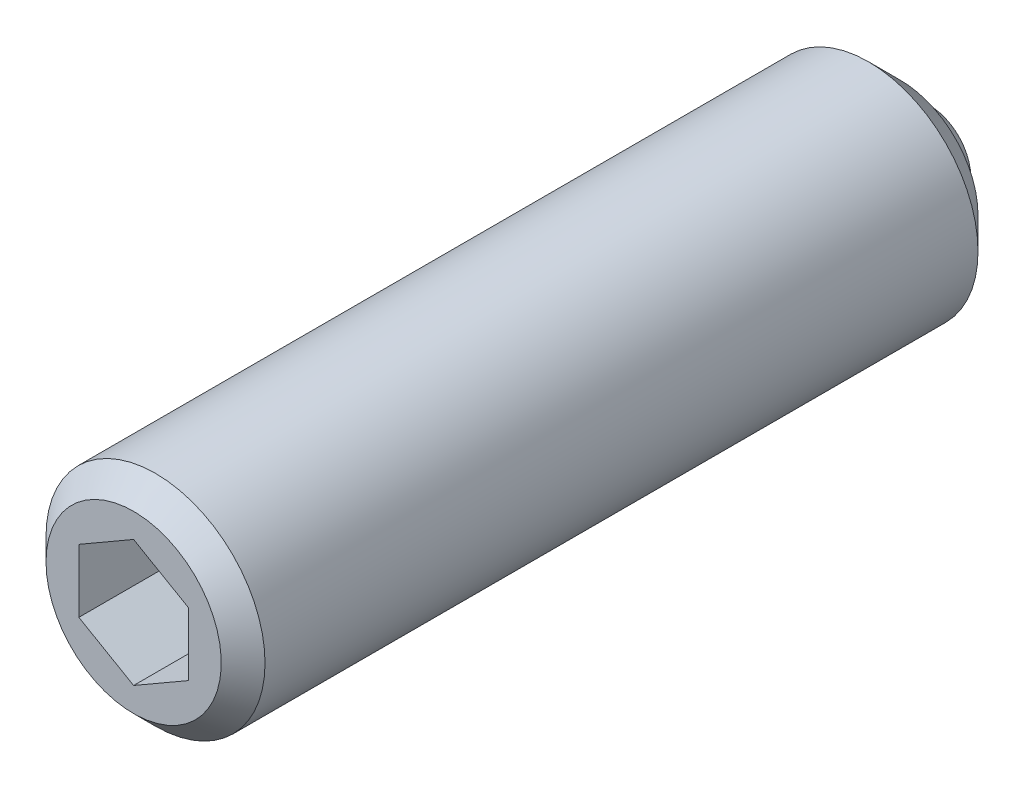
ISO-10303-21;
HEADER;
FILE_DESCRIPTION(('STEP AP214'),'2;1');
FILE_NAME('part.step','',(''),(''),'','','');
FILE_SCHEMA(('AUTOMOTIVE_DESIGN { 1 0 10303 214 1 1 1 1 }'));
ENDSEC;
DATA;
#1=APPLICATION_CONTEXT('core data for automotive mechanical design processes');
#2=APPLICATION_PROTOCOL_DEFINITION('international standard','automotive_design',2000,#1);
#3=PRODUCT_CONTEXT('',#1,'mechanical');
#4=PRODUCT('Part','Part','',(#3));
#5=PRODUCT_RELATED_PRODUCT_CATEGORY('part','',(#4));
#6=PRODUCT_DEFINITION_FORMATION('','',#4);
#7=PRODUCT_DEFINITION_CONTEXT('part definition',#1,'design');
#8=PRODUCT_DEFINITION('design','',#6,#7);
#9=PRODUCT_DEFINITION_SHAPE('','',#8);
#10=(LENGTH_UNIT() NAMED_UNIT(*) SI_UNIT(.MILLI.,.METRE.));
#11=(NAMED_UNIT(*) PLANE_ANGLE_UNIT() SI_UNIT($,.RADIAN.));
#12=(NAMED_UNIT(*) SI_UNIT($,.STERADIAN.) SOLID_ANGLE_UNIT());
#13=UNCERTAINTY_MEASURE_WITH_UNIT(LENGTH_MEASURE(1.E-05),#10,'distance_accuracy_value','');
#14=(GEOMETRIC_REPRESENTATION_CONTEXT(3) GLOBAL_UNCERTAINTY_ASSIGNED_CONTEXT((#13)) GLOBAL_UNIT_ASSIGNED_CONTEXT((#10,
#11,#12)) REPRESENTATION_CONTEXT('',''));
#15=CARTESIAN_POINT('',(0.,0.,0.));
#16=DIRECTION('',(0.,0.,1.));
#17=DIRECTION('',(1.,0.,0.));
#18=AXIS2_PLACEMENT_3D('',#15,#16,#17);
#19=CARTESIAN_POINT('',(5.04709724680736E-10,0.,-12.1421356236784));
#20=DIRECTION('',(-4.15668001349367E-11,0.,1.));
#21=DIRECTION('',(1.,0.,4.15668001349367E-11));
#22=AXIS2_PLACEMENT_3D('',#19,#20,#21);
#23=CYLINDRICAL_SURFACE('',#22,5.);
#24=CARTESIAN_POINT('',(-1.4964048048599E-09,-1.52491229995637E-13,36.0000000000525));
#25=DIRECTION('',(4.15668001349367E-11,0.,-1.));
#26=DIRECTION('',(-1.,0.,-4.15668001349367E-11));
#27=AXIS2_PLACEMENT_3D('',#24,#25,#26);
#28=CIRCLE('',#27,5.);
#29=CARTESIAN_POINT('',(-5.0000000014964,-1.52491229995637E-13,35.9999999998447));
#30=VERTEX_POINT('',#29);
#31=EDGE_CURVE('E9',#30,#30,#28,.T.);
#32=ORIENTED_EDGE('',*,*,#31,.T.);
#33=EDGE_LOOP('',(#32));
#34=FACE_BOUND('',#33,.T.);
#35=CARTESIAN_POINT('',(-1.43405460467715E-10,0.,3.45000000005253));
#36=DIRECTION('',(-4.15668001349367E-11,0.,1.));
#37=DIRECTION('',(1.,0.,4.15668001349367E-11));
#38=AXIS2_PLACEMENT_3D('',#35,#36,#37);
#39=CIRCLE('',#38,5.);
#40=CARTESIAN_POINT('',(4.99999999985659,0.,3.45000000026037));
#41=VERTEX_POINT('',#40);
#42=EDGE_CURVE('E118',#41,#41,#39,.T.);
#43=ORIENTED_EDGE('',*,*,#42,.T.);
#44=EDGE_LOOP('',(#43));
#45=FACE_BOUND('',#44,.T.);
#46=ADVANCED_FACE('F14',(#34,#45),#23,.T.);
#47=CARTESIAN_POINT('',(1.24999999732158,3.60843918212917,33.0000000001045));
#48=DIRECTION('',(4.15668001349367E-11,0.,-1.));
#49=DIRECTION('',(0.500000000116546,-0.866025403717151,2.07797317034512E-11));
#50=AXIS2_PLACEMENT_3D('',#47,#48,#49);
#51=PLANE('',#50);
#52=DIRECTION('',(0.866025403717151,0.500000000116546,3.6000022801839E-11));
#53=VECTOR('',#52,1.);
#54=CARTESIAN_POINT('',(1.24999999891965,-2.16506350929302,33.0000000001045));
#55=LINE('',#54,#53);
#56=CARTESIAN_POINT('',(-2.14420061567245E-10,-2.88675134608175,33.0000000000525));
#57=VERTEX_POINT('',#56);
#58=CARTESIAN_POINT('',(2.49999999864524,-1.44337567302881,33.0000000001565));
#59=VERTEX_POINT('',#58);
#60=EDGE_CURVE('E109',#57,#59,#55,.T.);
#61=ORIENTED_EDGE('',*,*,#60,.T.);
#62=DIRECTION('',(0.,1.,0.));
#63=VECTOR('',#62,1.);
#64=CARTESIAN_POINT('',(2.49999999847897,-3.27267943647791E-10,33.0000000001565));
#65=LINE('',#64,#63);
#66=CARTESIAN_POINT('',(2.49999999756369,1.44337567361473,33.0000000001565));
#67=VERTEX_POINT('',#66);
#68=EDGE_CURVE('E105',#59,#67,#65,.T.);
#69=ORIENTED_EDGE('',*,*,#68,.T.);
#70=DIRECTION('',(-0.866025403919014,0.499999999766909,-3.59957869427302E-11));
#71=VECTOR('',#70,1.);
#72=CARTESIAN_POINT('',(1.2499999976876,2.16506350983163,33.0000000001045));
#73=LINE('',#72,#71);
#74=CARTESIAN_POINT('',(-2.52900131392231E-09,2.88675134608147,33.0000000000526));
#75=VERTEX_POINT('',#74);
#76=EDGE_CURVE('E101',#67,#75,#73,.T.);
#77=ORIENTED_EDGE('',*,*,#76,.T.);
#78=DIRECTION('',(-0.866025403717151,-0.500000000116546,-3.6000022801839E-11));
#79=VECTOR('',#78,1.);
#80=CARTESIAN_POINT('',(-1.25000000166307,2.16506350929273,33.0000000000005));
#81=LINE('',#80,#79);
#82=CARTESIAN_POINT('',(-2.50000000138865,1.44337567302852,32.9999999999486));
#83=VERTEX_POINT('',#82);
#84=EDGE_CURVE('E46',#75,#83,#81,.T.);
#85=ORIENTED_EDGE('',*,*,#84,.T.);
#86=DIRECTION('',(0.,-1.,0.));
#87=VECTOR('',#86,1.);
#88=CARTESIAN_POINT('',(-2.50000000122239,3.26976943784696E-10,32.9999999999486));
#89=LINE('',#88,#87);
#90=CARTESIAN_POINT('',(-2.50000000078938,-1.44337567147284,32.9999999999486));
#91=VERTEX_POINT('',#90);
#92=EDGE_CURVE('E83',#83,#91,#89,.T.);
#93=ORIENTED_EDGE('',*,*,#92,.T.);
#94=DIRECTION('',(0.866025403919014,-0.499999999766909,3.59957869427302E-11));
#95=VECTOR('',#94,1.);
#96=CARTESIAN_POINT('',(-1.25000000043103,-2.16506350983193,33.0000000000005));
#97=LINE('',#96,#95);
#98=EDGE_CURVE('E31',#91,#57,#97,.T.);
#99=ORIENTED_EDGE('',*,*,#98,.T.);
#100=EDGE_LOOP('',(#61,#69,#77,#85,#93,#99));
#101=FACE_BOUND('',#100,.T.);
#102=ADVANCED_FACE('F135',(#101),#51,.F.);
#103=CARTESIAN_POINT('',(-2.50000000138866,-1.4433756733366,36.9999999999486));
#104=DIRECTION('',(-1.,0.,-4.15668001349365E-11));
#105=DIRECTION('',(0.,1.,0.));
#106=AXIS2_PLACEMENT_3D('',#103,#104,#105);
#107=PLANE('',#106);
#108=ORIENTED_EDGE('',*,*,#92,.F.);
#109=DIRECTION('',(4.15668001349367E-11,0.,-1.));
#110=VECTOR('',#109,1.);
#111=CARTESIAN_POINT('',(-2.50000000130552,1.44337567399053,34.9999999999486));
#112=LINE('',#111,#110);
#113=CARTESIAN_POINT('',(-2.50000000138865,1.44337567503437,36.9999999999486));
#114=VERTEX_POINT('',#113);
#115=EDGE_CURVE('E80',#114,#83,#112,.T.);
#116=ORIENTED_EDGE('',*,*,#115,.F.);
#117=DIRECTION('',(0.,1.,0.));
#118=VECTOR('',#117,1.);
#119=CARTESIAN_POINT('',(-2.50000000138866,-1.4433756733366,36.9999999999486));
#120=LINE('',#119,#118);
#121=CARTESIAN_POINT('',(-2.50000000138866,-1.4433756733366,36.9999999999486));
#122=VERTEX_POINT('',#121);
#123=EDGE_CURVE('E82',#114,#122,#120,.F.);
#124=ORIENTED_EDGE('',*,*,#123,.T.);
#125=DIRECTION('',(-4.15668001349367E-11,0.,1.));
#126=VECTOR('',#125,1.);
#127=CARTESIAN_POINT('',(-2.50000000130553,-1.44337567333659,34.9999999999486));
#128=LINE('',#127,#126);
#129=EDGE_CURVE('E115',#91,#122,#128,.T.);
#130=ORIENTED_EDGE('',*,*,#129,.F.);
#131=EDGE_LOOP('',(#108,#116,#124,#130));
#132=FACE_BOUND('',#131,.T.);
#133=ADVANCED_FACE('F81',(#132),#107,.F.);
#134=CARTESIAN_POINT('',(1.94072622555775E-10,-2.88675134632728,37.0000000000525));
#135=DIRECTION('',(-0.499999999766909,-0.866025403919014,-2.07870684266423E-11));
#136=DIRECTION('',(-0.866025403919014,0.499999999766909,-3.59957869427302E-11));
#137=AXIS2_PLACEMENT_3D('',#134,#135,#136);
#138=PLANE('',#137);
#139=ORIENTED_EDGE('',*,*,#98,.F.);
#140=ORIENTED_EDGE('',*,*,#129,.T.);
#141=DIRECTION('',(-0.866025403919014,0.499999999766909,-3.59957869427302E-11));
#142=VECTOR('',#141,1.);
#143=CARTESIAN_POINT('',(1.94072622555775E-10,-2.88675134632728,37.0000000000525));
#144=LINE('',#143,#142);
#145=CARTESIAN_POINT('',(4.60814979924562E-10,-2.88675134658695,37.0000000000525));
#146=VERTEX_POINT('',#145);
#147=EDGE_CURVE('E60',#122,#146,#144,.F.);
#148=ORIENTED_EDGE('',*,*,#147,.T.);
#149=DIRECTION('',(4.15668001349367E-11,0.,-1.));
#150=VECTOR('',#149,1.);
#151=CARTESIAN_POINT('',(-1.08881827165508E-09,-2.88675134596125,35.0000000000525));
#152=LINE('',#151,#150);
#153=EDGE_CURVE('E108',#146,#57,#152,.T.);
#154=ORIENTED_EDGE('',*,*,#153,.T.);
#155=EDGE_LOOP('',(#139,#140,#148,#154));
#156=FACE_BOUND('',#155,.T.);
#157=ADVANCED_FACE('F155',(#156),#138,.F.);
#158=CARTESIAN_POINT('',(2.49999999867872,-1.44337567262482,37.0000000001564));
#159=DIRECTION('',(0.500000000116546,-0.866025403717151,2.07797317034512E-11));
#160=DIRECTION('',(-0.866025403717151,-0.500000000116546,-3.6000022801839E-11));
#161=AXIS2_PLACEMENT_3D('',#158,#159,#160);
#162=PLANE('',#161);
#163=ORIENTED_EDGE('',*,*,#60,.F.);
#164=ORIENTED_EDGE('',*,*,#153,.F.);
#165=DIRECTION('',(0.866025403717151,0.500000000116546,3.6000022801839E-11));
#166=VECTOR('',#165,1.);
#167=CARTESIAN_POINT('',(1.25000000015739,-2.16506351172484,37.0000000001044));
#168=LINE('',#167,#166);
#169=CARTESIAN_POINT('',(2.4999999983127,-1.44337567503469,37.0000000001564));
#170=VERTEX_POINT('',#169);
#171=EDGE_CURVE('E257',#146,#170,#168,.T.);
#172=ORIENTED_EDGE('',*,*,#171,.T.);
#173=DIRECTION('',(4.15668001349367E-11,0.,-1.));
#174=VECTOR('',#173,1.);
#175=CARTESIAN_POINT('',(2.49999999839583,-1.44337567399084,35.0000000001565));
#176=LINE('',#175,#174);
#177=EDGE_CURVE('E98',#170,#59,#176,.T.);
#178=ORIENTED_EDGE('',*,*,#177,.T.);
#179=EDGE_LOOP('',(#163,#164,#172,#178));
#180=FACE_BOUND('',#179,.T.);
#181=ADVANCED_FACE('F165',(#180),#162,.F.);
#182=CARTESIAN_POINT('',(2.4999999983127,1.44337567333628,37.0000000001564));
#183=DIRECTION('',(1.,0.,4.15668001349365E-11));
#184=DIRECTION('',(0.,-1.,0.));
#185=AXIS2_PLACEMENT_3D('',#182,#183,#184);
#186=PLANE('',#185);
#187=ORIENTED_EDGE('',*,*,#68,.F.);
#188=ORIENTED_EDGE('',*,*,#177,.F.);
#189=DIRECTION('',(0.,-1.,0.));
#190=VECTOR('',#189,1.);
#191=CARTESIAN_POINT('',(2.4999999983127,1.44337567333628,37.0000000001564));
#192=LINE('',#191,#190);
#193=CARTESIAN_POINT('',(2.4999999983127,1.44337567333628,37.0000000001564));
#194=VERTEX_POINT('',#193);
#195=EDGE_CURVE('E94',#170,#194,#192,.F.);
#196=ORIENTED_EDGE('',*,*,#195,.T.);
#197=DIRECTION('',(4.15668001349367E-11,0.,-1.));
#198=VECTOR('',#197,1.);
#199=CARTESIAN_POINT('',(2.49999999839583,1.44337567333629,35.0000000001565));
#200=LINE('',#199,#198);
#201=EDGE_CURVE('E102',#194,#67,#200,.T.);
#202=ORIENTED_EDGE('',*,*,#201,.T.);
#203=EDGE_LOOP('',(#187,#188,#196,#202));
#204=FACE_BOUND('',#203,.T.);
#205=ADVANCED_FACE('F161',(#204),#186,.F.);
#206=CARTESIAN_POINT('',(-3.27002791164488E-09,2.88675134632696,37.0000000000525));
#207=DIRECTION('',(0.499999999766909,0.866025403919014,2.07870684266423E-11));
#208=DIRECTION('',(0.866025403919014,-0.499999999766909,3.59957869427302E-11));
#209=AXIS2_PLACEMENT_3D('',#206,#207,#208);
#210=PLANE('',#209);
#211=ORIENTED_EDGE('',*,*,#76,.F.);
#212=ORIENTED_EDGE('',*,*,#201,.F.);
#213=DIRECTION('',(0.866025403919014,-0.499999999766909,3.59957869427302E-11));
#214=VECTOR('',#213,1.);
#215=CARTESIAN_POINT('',(-3.27002791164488E-09,2.88675134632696,37.0000000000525));
#216=LINE('',#215,#214);
#217=CARTESIAN_POINT('',(-3.53676810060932E-09,2.88675134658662,37.0000000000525));
#218=VERTEX_POINT('',#217);
#219=EDGE_CURVE('E92',#194,#218,#216,.F.);
#220=ORIENTED_EDGE('',*,*,#219,.T.);
#221=DIRECTION('',(4.15668001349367E-11,0.,-1.));
#222=VECTOR('',#221,1.);
#223=CARTESIAN_POINT('',(-1.82086810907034E-09,2.88675134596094,35.0000000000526));
#224=LINE('',#223,#222);
#225=EDGE_CURVE('E74',#218,#75,#224,.T.);
#226=ORIENTED_EDGE('',*,*,#225,.T.);
#227=EDGE_LOOP('',(#211,#212,#220,#226));
#228=FACE_BOUND('',#227,.T.);
#229=ADVANCED_FACE('F158',(#228),#210,.F.);
#230=CARTESIAN_POINT('',(-2.50000000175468,1.4433756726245,36.9999999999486));
#231=DIRECTION('',(-0.500000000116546,0.866025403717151,-2.07797317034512E-11));
#232=DIRECTION('',(0.866025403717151,0.500000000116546,3.6000022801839E-11));
#233=AXIS2_PLACEMENT_3D('',#230,#231,#232);
#234=PLANE('',#233);
#235=ORIENTED_EDGE('',*,*,#84,.F.);
#236=ORIENTED_EDGE('',*,*,#225,.F.);
#237=DIRECTION('',(-0.866025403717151,-0.500000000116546,-3.6000022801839E-11));
#238=VECTOR('',#237,1.);
#239=CARTESIAN_POINT('',(-1.25000000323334,2.16506351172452,37.0000000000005));
#240=LINE('',#239,#238);
#241=EDGE_CURVE('E87',#218,#114,#240,.T.);
#242=ORIENTED_EDGE('',*,*,#241,.T.);
#243=ORIENTED_EDGE('',*,*,#115,.T.);
#244=EDGE_LOOP('',(#235,#236,#242,#243));
#245=FACE_BOUND('',#244,.T.);
#246=ADVANCED_FACE('F91',(#245),#234,.F.);
#247=CARTESIAN_POINT('',(1.29646197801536,4.83846198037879,37.0000000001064));
#248=DIRECTION('',(4.15668001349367E-11,0.,-1.));
#249=DIRECTION('',(0.500000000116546,-0.866025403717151,2.07797317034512E-11));
#250=AXIS2_PLACEMENT_3D('',#247,#248,#249);
#251=PLANE('',#250);
#252=CARTESIAN_POINT('',(-1.53797160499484E-09,-1.5672709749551E-13,37.0000000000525));
#253=DIRECTION('',(4.15668001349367E-11,0.,-1.));
#254=DIRECTION('',(-1.,0.,-4.15668001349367E-11));
#255=AXIS2_PLACEMENT_3D('',#252,#253,#254);
#256=CIRCLE('',#255,4.);
#257=CARTESIAN_POINT('',(-4.00000000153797,-1.5672709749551E-13,36.9999999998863));
#258=VERTEX_POINT('',#257);
#259=EDGE_CURVE('E23',#258,#258,#256,.F.);
#260=ORIENTED_EDGE('',*,*,#259,.T.);
#261=EDGE_LOOP('',(#260));
#262=FACE_BOUND('',#261,.T.);
#263=ORIENTED_EDGE('',*,*,#241,.F.);
#264=ORIENTED_EDGE('',*,*,#219,.F.);
#265=ORIENTED_EDGE('',*,*,#195,.F.);
#266=ORIENTED_EDGE('',*,*,#171,.F.);
#267=ORIENTED_EDGE('',*,*,#147,.F.);
#268=ORIENTED_EDGE('',*,*,#123,.F.);
#269=EDGE_LOOP('',(#263,#264,#265,#266,#267,#268));
#270=FACE_BOUND('',#269,.T.);
#271=ADVANCED_FACE('F85',(#262,#270),#251,.F.);
#272=CARTESIAN_POINT('',(-1.24700241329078E-10,0.,3.00000000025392));
#273=DIRECTION('',(-4.15661408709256E-11,0.,1.));
#274=DIRECTION('',(-0.866025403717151,-0.500000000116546,-3.6000022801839E-11));
#275=AXIS2_PLACEMENT_3D('',#272,#273,#274);
#276=SPHERICAL_SURFACE('',#275,3.00000000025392);
#277=CARTESIAN_POINT('',(-8.31341004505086E-11,0.,2.00000000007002));
#278=DIRECTION('',(-4.15661408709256E-11,0.,1.));
#279=DIRECTION('',(-0.500000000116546,0.866025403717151,-2.07784131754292E-11));
#280=AXIS2_PLACEMENT_3D('',#277,#278,#279);
#281=CIRCLE('',#280,2.82842712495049);
#282=CARTESIAN_POINT('',(-1.41421356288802,2.44948974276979,2.00000000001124));
#283=VERTEX_POINT('',#282);
#284=EDGE_CURVE('E89',#283,#283,#281,.T.);
#285=ORIENTED_EDGE('',*,*,#284,.F.);
#286=EDGE_LOOP('',(#285));
#287=FACE_BOUND('',#286,.T.);
#288=ADVANCED_FACE('F146',(#287),#276,.T.);
#289=CARTESIAN_POINT('',(4.9075828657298,-1.31498286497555,2.00000000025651));
#290=DIRECTION('',(-4.15668001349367E-11,0.,1.));
#291=DIRECTION('',(-0.500000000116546,0.866025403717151,-2.07797317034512E-11));
#292=AXIS2_PLACEMENT_3D('',#289,#290,#291);
#293=PLANE('',#292);
#294=CARTESIAN_POINT('',(-8.31336002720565E-11,0.,2.00000000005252));
#295=DIRECTION('',(-4.15668001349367E-11,0.,1.));
#296=DIRECTION('',(1.,0.,4.15668001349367E-11));
#297=AXIS2_PLACEMENT_3D('',#294,#295,#296);
#298=CIRCLE('',#297,3.55);
#299=CARTESIAN_POINT('',(3.54999999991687,0.,2.00000000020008));
#300=VERTEX_POINT('',#299);
#301=EDGE_CURVE('E107',#300,#300,#298,.F.);
#302=ORIENTED_EDGE('',*,*,#301,.T.);
#303=EDGE_LOOP('',(#302));
#304=FACE_BOUND('',#303,.T.);
#305=ORIENTED_EDGE('',*,*,#284,.T.);
#306=EDGE_LOOP('',(#305));
#307=FACE_BOUND('',#306,.T.);
#308=ADVANCED_FACE('F131',(#304,#307),#293,.F.);
#309=CARTESIAN_POINT('',(-8.31336002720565E-11,0.,2.00000000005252));
#310=DIRECTION('',(-4.15668001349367E-11,0.,1.));
#311=DIRECTION('',(1.,0.,4.15668001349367E-11));
#312=AXIS2_PLACEMENT_3D('',#309,#310,#311);
#313=CONICAL_SURFACE('',#312,3.55,0.785398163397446);
#314=ORIENTED_EDGE('',*,*,#42,.F.);
#315=EDGE_LOOP('',(#314));
#316=FACE_BOUND('',#315,.T.);
#317=ORIENTED_EDGE('',*,*,#301,.F.);
#318=EDGE_LOOP('',(#317));
#319=FACE_BOUND('',#318,.T.);
#320=ADVANCED_FACE('F125',(#316,#319),#313,.T.);
#321=CARTESIAN_POINT('',(-1.53797160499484E-09,-1.5672709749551E-13,37.0000000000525));
#322=DIRECTION('',(4.15668001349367E-11,0.,-1.));
#323=DIRECTION('',(-1.,0.,-4.15668001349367E-11));
#324=AXIS2_PLACEMENT_3D('',#321,#322,#323);
#325=CONICAL_SURFACE('',#324,4.,0.785398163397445);
#326=ORIENTED_EDGE('',*,*,#31,.F.);
#327=EDGE_LOOP('',(#326));
#328=FACE_BOUND('',#327,.T.);
#329=ORIENTED_EDGE('',*,*,#259,.F.);
#330=EDGE_LOOP('',(#329));
#331=FACE_BOUND('',#330,.T.);
#332=ADVANCED_FACE('F16',(#328,#331),#325,.T.);
#333=CLOSED_SHELL('',(#46,#102,#133,#157,#181,#205,#229,#246,#271,#288,#308,#320,#332));
#334=MANIFOLD_SOLID_BREP('B1',#333);
#335=ADVANCED_BREP_SHAPE_REPRESENTATION('',(#18,#334),#14);
#336=SHAPE_DEFINITION_REPRESENTATION(#9,#335);
ENDSEC;
END-ISO-10303-21;
